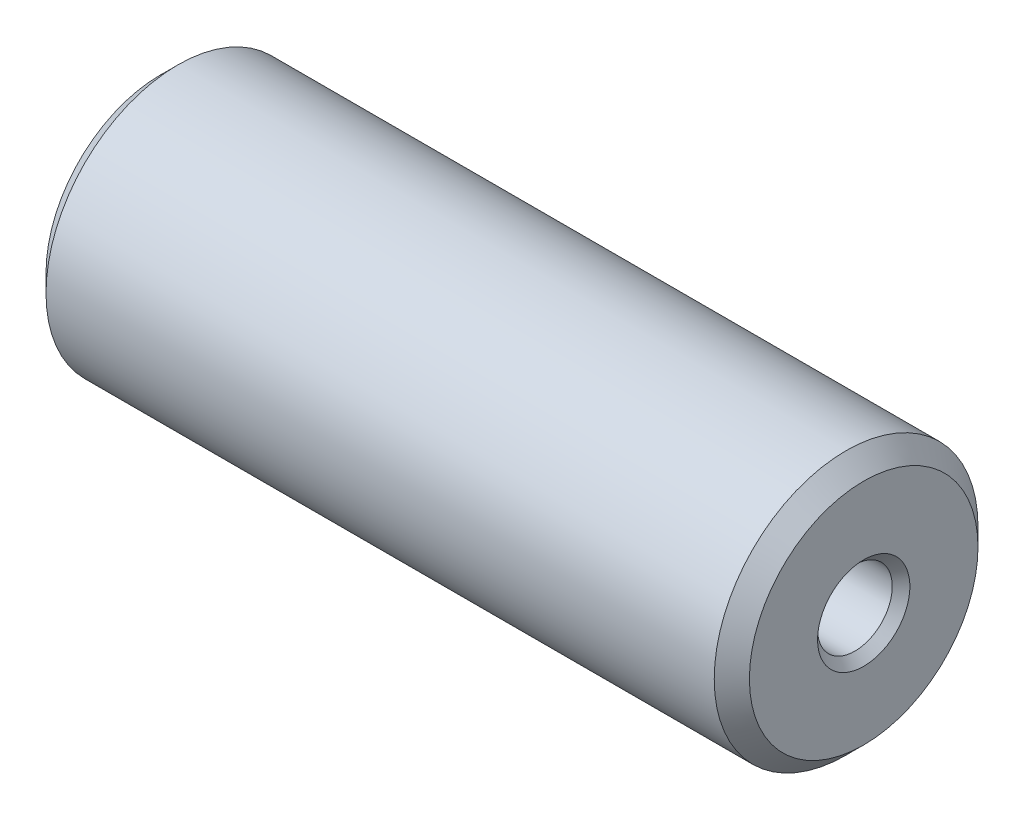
ISO-10303-21;
HEADER;
FILE_DESCRIPTION(('STEP AP214'),'2;1');
FILE_NAME('part.step','',(''),(''),'','','');
FILE_SCHEMA(('AUTOMOTIVE_DESIGN { 1 0 10303 214 1 1 1 1 }'));
ENDSEC;
DATA;
#1=APPLICATION_CONTEXT('core data for automotive mechanical design processes');
#2=APPLICATION_PROTOCOL_DEFINITION('international standard','automotive_design',2000,#1);
#3=PRODUCT_CONTEXT('',#1,'mechanical');
#4=PRODUCT('Part','Part','',(#3));
#5=PRODUCT_RELATED_PRODUCT_CATEGORY('part','',(#4));
#6=PRODUCT_DEFINITION_FORMATION('','',#4);
#7=PRODUCT_DEFINITION_CONTEXT('part definition',#1,'design');
#8=PRODUCT_DEFINITION('design','',#6,#7);
#9=PRODUCT_DEFINITION_SHAPE('','',#8);
#10=(LENGTH_UNIT() NAMED_UNIT(*) SI_UNIT(.MILLI.,.METRE.));
#11=(NAMED_UNIT(*) PLANE_ANGLE_UNIT() SI_UNIT($,.RADIAN.));
#12=(NAMED_UNIT(*) SI_UNIT($,.STERADIAN.) SOLID_ANGLE_UNIT());
#13=UNCERTAINTY_MEASURE_WITH_UNIT(LENGTH_MEASURE(1.E-05),#10,'distance_accuracy_value','');
#14=(GEOMETRIC_REPRESENTATION_CONTEXT(3) GLOBAL_UNCERTAINTY_ASSIGNED_CONTEXT((#13)) GLOBAL_UNIT_ASSIGNED_CONTEXT((#10,
#11,#12)) REPRESENTATION_CONTEXT('',''));
#15=CARTESIAN_POINT('',(0.,0.,0.));
#16=DIRECTION('',(0.,0.,1.));
#17=DIRECTION('',(1.,0.,0.));
#18=AXIS2_PLACEMENT_3D('',#15,#16,#17);
#19=CARTESIAN_POINT('',(0.,0.,0.));
#20=DIRECTION('',(1.,0.,0.));
#21=DIRECTION('',(0.,0.,-0.999999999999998));
#22=AXIS2_PLACEMENT_3D('',#19,#20,#21);
#23=PLANE('',#22);
#24=CARTESIAN_POINT('',(0.,0.,0.));
#25=DIRECTION('',(1.,0.,0.));
#26=DIRECTION('',(0.,0.,-0.999999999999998));
#27=AXIS2_PLACEMENT_3D('',#24,#25,#26);
#28=CIRCLE('',#27,13.);
#29=CARTESIAN_POINT('',(0.,-1.08246744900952E-13,-12.9999999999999));
#30=VERTEX_POINT('',#29);
#31=EDGE_CURVE('E10',#30,#30,#28,.F.);
#32=ORIENTED_EDGE('',*,*,#31,.T.);
#33=EDGE_LOOP('',(#32));
#34=FACE_BOUND('',#33,.T.);
#35=CARTESIAN_POINT('',(0.,0.,0.));
#36=DIRECTION('',(1.,0.,0.));
#37=DIRECTION('',(0.,0.,-0.999999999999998));
#38=AXIS2_PLACEMENT_3D('',#35,#36,#37);
#39=CIRCLE('',#38,5.24999999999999);
#40=CARTESIAN_POINT('',(0.,0.,-5.24999999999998));
#41=VERTEX_POINT('',#40);
#42=EDGE_CURVE('E54',#41,#41,#39,.T.);
#43=ORIENTED_EDGE('',*,*,#42,.T.);
#44=EDGE_LOOP('',(#43));
#45=FACE_BOUND('',#44,.T.);
#46=ADVANCED_FACE('F34',(#34,#45),#23,.F.);
#47=CARTESIAN_POINT('',(0.,0.,0.));
#48=DIRECTION('',(-1.,0.,0.));
#49=DIRECTION('',(0.,0.,0.999999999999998));
#50=AXIS2_PLACEMENT_3D('',#47,#48,#49);
#51=CYLINDRICAL_SURFACE('',#50,15.);
#52=CARTESIAN_POINT('',(78.0000000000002,2.22044604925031E-13,0.));
#53=DIRECTION('',(-1.,0.,0.));
#54=DIRECTION('',(0.,0.,0.999999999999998));
#55=AXIS2_PLACEMENT_3D('',#52,#53,#54);
#56=CIRCLE('',#55,15.);
#57=CARTESIAN_POINT('',(78.0000000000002,3.46944695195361E-13,15.));
#58=VERTEX_POINT('',#57);
#59=EDGE_CURVE('E45',#58,#58,#56,.T.);
#60=ORIENTED_EDGE('',*,*,#59,.T.);
#61=EDGE_LOOP('',(#60));
#62=FACE_BOUND('',#61,.T.);
#63=CARTESIAN_POINT('',(1.99999999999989,0.,0.));
#64=DIRECTION('',(1.,0.,0.));
#65=DIRECTION('',(0.,0.,-0.999999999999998));
#66=AXIS2_PLACEMENT_3D('',#63,#64,#65);
#67=CIRCLE('',#66,15.);
#68=CARTESIAN_POINT('',(1.99999999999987,-1.2490009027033E-13,-15.));
#69=VERTEX_POINT('',#68);
#70=EDGE_CURVE('E49',#69,#69,#67,.T.);
#71=ORIENTED_EDGE('',*,*,#70,.T.);
#72=EDGE_LOOP('',(#71));
#73=FACE_BOUND('',#72,.T.);
#74=ADVANCED_FACE('F87',(#62,#73),#51,.T.);
#75=CARTESIAN_POINT('',(80.0000000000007,-4.44089209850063E-13,6.66133814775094E-13));
#76=DIRECTION('',(-1.,0.,0.));
#77=DIRECTION('',(0.,0.,0.999999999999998));
#78=AXIS2_PLACEMENT_3D('',#75,#76,#77);
#79=PLANE('',#78);
#80=CARTESIAN_POINT('',(80.0000000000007,-4.44089209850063E-13,6.66133814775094E-13));
#81=DIRECTION('',(-1.,0.,0.));
#82=DIRECTION('',(0.,0.,0.999999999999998));
#83=AXIS2_PLACEMENT_3D('',#80,#81,#82);
#84=CIRCLE('',#83,13.);
#85=CARTESIAN_POINT('',(80.0000000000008,-3.3584246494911E-13,13.0000000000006));
#86=VERTEX_POINT('',#85);
#87=EDGE_CURVE('E41',#86,#86,#84,.F.);
#88=ORIENTED_EDGE('',*,*,#87,.T.);
#89=EDGE_LOOP('',(#88));
#90=FACE_BOUND('',#89,.T.);
#91=CARTESIAN_POINT('',(80.0000000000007,-4.44089209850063E-13,6.66133814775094E-13));
#92=DIRECTION('',(-1.,0.,0.));
#93=DIRECTION('',(0.,0.,0.999999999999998));
#94=AXIS2_PLACEMENT_3D('',#91,#92,#93);
#95=CIRCLE('',#94,5.25);
#96=CARTESIAN_POINT('',(80.0000000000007,-4.00374178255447E-13,5.25000000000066));
#97=VERTEX_POINT('',#96);
#98=EDGE_CURVE('E63',#97,#97,#95,.T.);
#99=ORIENTED_EDGE('',*,*,#98,.T.);
#100=EDGE_LOOP('',(#99));
#101=FACE_BOUND('',#100,.T.);
#102=ADVANCED_FACE('F67',(#90,#101),#79,.F.);
#103=CARTESIAN_POINT('',(80.0000000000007,-4.44089209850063E-13,6.66133814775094E-13));
#104=DIRECTION('',(-1.,0.,0.));
#105=DIRECTION('',(0.,0.,0.999999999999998));
#106=AXIS2_PLACEMENT_3D('',#103,#104,#105);
#107=CYLINDRICAL_SURFACE('',#106,4.25);
#108=CARTESIAN_POINT('',(79.0000000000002,0.,-4.44089209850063E-13));
#109=DIRECTION('',(-1.,0.,0.));
#110=DIRECTION('',(0.,0.,0.999999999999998));
#111=AXIS2_PLACEMENT_3D('',#108,#109,#110);
#112=CIRCLE('',#111,4.25);
#113=CARTESIAN_POINT('',(79.0000000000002,0.,4.24999999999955));
#114=VERTEX_POINT('',#113);
#115=EDGE_CURVE('E57',#114,#114,#112,.F.);
#116=ORIENTED_EDGE('',*,*,#115,.T.);
#117=EDGE_LOOP('',(#116));
#118=FACE_BOUND('',#117,.T.);
#119=CARTESIAN_POINT('',(1.,0.,0.));
#120=DIRECTION('',(1.,0.,0.));
#121=DIRECTION('',(0.,0.,-0.999999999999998));
#122=AXIS2_PLACEMENT_3D('',#119,#120,#121);
#123=CIRCLE('',#122,4.25);
#124=CARTESIAN_POINT('',(0.999999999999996,0.,-4.24999999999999));
#125=VERTEX_POINT('',#124);
#126=EDGE_CURVE('E60',#125,#125,#123,.F.);
#127=ORIENTED_EDGE('',*,*,#126,.T.);
#128=EDGE_LOOP('',(#127));
#129=FACE_BOUND('',#128,.T.);
#130=ADVANCED_FACE('F72',(#118,#129),#107,.F.);
#131=CARTESIAN_POINT('',(80.0000000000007,-4.44089209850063E-13,6.66133814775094E-13));
#132=DIRECTION('',(1.,0.,0.));
#133=DIRECTION('',(0.,0.,-0.999999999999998));
#134=AXIS2_PLACEMENT_3D('',#131,#132,#133);
#135=CONICAL_SURFACE('',#134,5.25,0.78539816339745);
#136=ORIENTED_EDGE('',*,*,#115,.F.);
#137=EDGE_LOOP('',(#136));
#138=FACE_BOUND('',#137,.T.);
#139=ORIENTED_EDGE('',*,*,#98,.F.);
#140=EDGE_LOOP('',(#139));
#141=FACE_BOUND('',#140,.T.);
#142=ADVANCED_FACE('F69',(#138,#141),#135,.F.);
#143=CARTESIAN_POINT('',(1.,0.,0.));
#144=DIRECTION('',(-1.,0.,0.));
#145=DIRECTION('',(0.,0.,0.999999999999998));
#146=AXIS2_PLACEMENT_3D('',#143,#144,#145);
#147=CONICAL_SURFACE('',#146,4.25,0.785398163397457);
#148=ORIENTED_EDGE('',*,*,#42,.F.);
#149=EDGE_LOOP('',(#148));
#150=FACE_BOUND('',#149,.T.);
#151=ORIENTED_EDGE('',*,*,#126,.F.);
#152=EDGE_LOOP('',(#151));
#153=FACE_BOUND('',#152,.T.);
#154=ADVANCED_FACE('F71',(#150,#153),#147,.F.);
#155=CARTESIAN_POINT('',(78.0000000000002,2.22044604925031E-13,0.));
#156=DIRECTION('',(-1.,0.,0.));
#157=DIRECTION('',(0.,0.,0.999999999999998));
#158=AXIS2_PLACEMENT_3D('',#155,#156,#157);
#159=CONICAL_SURFACE('',#158,15.,0.785398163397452);
#160=ORIENTED_EDGE('',*,*,#87,.F.);
#161=EDGE_LOOP('',(#160));
#162=FACE_BOUND('',#161,.T.);
#163=ORIENTED_EDGE('',*,*,#59,.F.);
#164=EDGE_LOOP('',(#163));
#165=FACE_BOUND('',#164,.T.);
#166=ADVANCED_FACE('F79',(#162,#165),#159,.T.);
#167=CARTESIAN_POINT('',(0.,0.,0.));
#168=DIRECTION('',(1.,0.,0.));
#169=DIRECTION('',(0.,0.,-0.999999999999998));
#170=AXIS2_PLACEMENT_3D('',#167,#168,#169);
#171=CONICAL_SURFACE('',#170,13.,0.78539816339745);
#172=ORIENTED_EDGE('',*,*,#70,.F.);
#173=EDGE_LOOP('',(#172));
#174=FACE_BOUND('',#173,.T.);
#175=ORIENTED_EDGE('',*,*,#31,.F.);
#176=EDGE_LOOP('',(#175));
#177=FACE_BOUND('',#176,.T.);
#178=ADVANCED_FACE('F36',(#174,#177),#171,.T.);
#179=CLOSED_SHELL('',(#46,#74,#102,#130,#142,#154,#166,#178));
#180=MANIFOLD_SOLID_BREP('B2',#179);
#181=ADVANCED_BREP_SHAPE_REPRESENTATION('',(#18,#180),#14);
#182=SHAPE_DEFINITION_REPRESENTATION(#9,#181);
ENDSEC;
END-ISO-10303-21;
